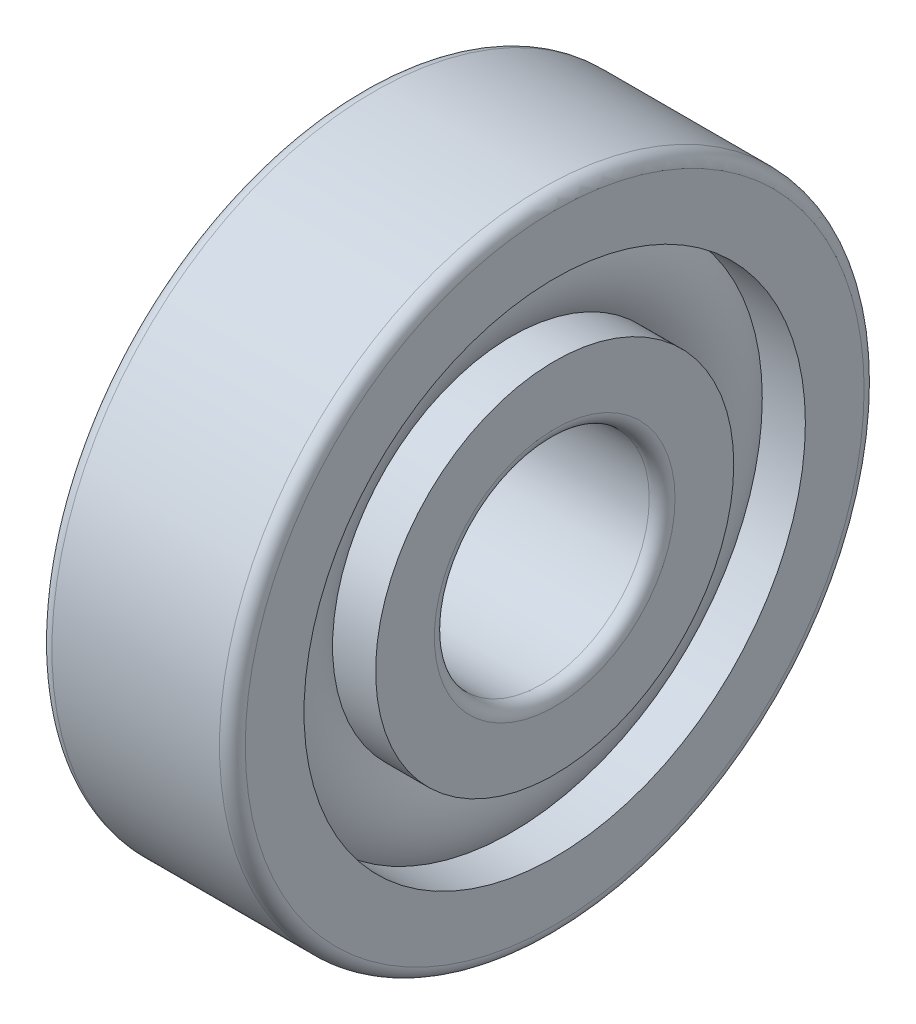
ISO-10303-21;
HEADER;
FILE_DESCRIPTION(('STEP AP214'),'2;1');
FILE_NAME('part.step','',(''),(''),'','','');
FILE_SCHEMA(('AUTOMOTIVE_DESIGN { 1 0 10303 214 1 1 1 1 }'));
ENDSEC;
DATA;
#1=APPLICATION_CONTEXT('core data for automotive mechanical design processes');
#2=APPLICATION_PROTOCOL_DEFINITION('international standard','automotive_design',2000,#1);
#3=PRODUCT_CONTEXT('',#1,'mechanical');
#4=PRODUCT('Part','Part','',(#3));
#5=PRODUCT_RELATED_PRODUCT_CATEGORY('part','',(#4));
#6=PRODUCT_DEFINITION_FORMATION('','',#4);
#7=PRODUCT_DEFINITION_CONTEXT('part definition',#1,'design');
#8=PRODUCT_DEFINITION('design','',#6,#7);
#9=PRODUCT_DEFINITION_SHAPE('','',#8);
#10=(LENGTH_UNIT() NAMED_UNIT(*) SI_UNIT(.MILLI.,.METRE.));
#11=(NAMED_UNIT(*) PLANE_ANGLE_UNIT() SI_UNIT($,.RADIAN.));
#12=(NAMED_UNIT(*) SI_UNIT($,.STERADIAN.) SOLID_ANGLE_UNIT());
#13=UNCERTAINTY_MEASURE_WITH_UNIT(LENGTH_MEASURE(1.E-05),#10,'distance_accuracy_value','');
#14=(GEOMETRIC_REPRESENTATION_CONTEXT(3) GLOBAL_UNCERTAINTY_ASSIGNED_CONTEXT((#13)) GLOBAL_UNIT_ASSIGNED_CONTEXT((#10,
#11,#12)) REPRESENTATION_CONTEXT('',''));
#15=CARTESIAN_POINT('',(0.,0.,0.));
#16=DIRECTION('',(0.,0.,1.));
#17=DIRECTION('',(1.,0.,0.));
#18=AXIS2_PLACEMENT_3D('',#15,#16,#17);
#19=CARTESIAN_POINT('',(0.599999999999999,0.,0.));
#20=DIRECTION('',(1.,0.,0.));
#21=DIRECTION('',(0.,0.,-1.));
#22=AXIS2_PLACEMENT_3D('',#19,#20,#21);
#23=TOROIDAL_SURFACE('',#22,14.4,0.599999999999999);
#24=CARTESIAN_POINT('',(0.,0.,0.));
#25=DIRECTION('',(1.,0.,0.));
#26=DIRECTION('',(0.,0.,-1.));
#27=AXIS2_PLACEMENT_3D('',#24,#25,#26);
#28=CIRCLE('',#27,14.4);
#29=CARTESIAN_POINT('',(0.,0.,-14.4));
#30=VERTEX_POINT('',#29);
#31=EDGE_CURVE('E10',#30,#30,#28,.T.);
#32=ORIENTED_EDGE('',*,*,#31,.T.);
#33=EDGE_LOOP('',(#32));
#34=FACE_BOUND('',#33,.T.);
#35=CARTESIAN_POINT('',(0.6,0.,0.));
#36=DIRECTION('',(1.,0.,0.));
#37=DIRECTION('',(0.,0.,-1.));
#38=AXIS2_PLACEMENT_3D('',#35,#36,#37);
#39=CIRCLE('',#38,15.);
#40=CARTESIAN_POINT('',(0.6,0.,-15.));
#41=VERTEX_POINT('',#40);
#42=EDGE_CURVE('E81',#41,#41,#39,.T.);
#43=ORIENTED_EDGE('',*,*,#42,.F.);
#44=EDGE_LOOP('',(#43));
#45=FACE_BOUND('',#44,.T.);
#46=ADVANCED_FACE('F29',(#34,#45),#23,.T.);
#47=CARTESIAN_POINT('',(0.,14.4,0.));
#48=DIRECTION('',(-1.,0.,0.));
#49=DIRECTION('',(0.,0.,1.));
#50=AXIS2_PLACEMENT_3D('',#47,#48,#49);
#51=PLANE('',#50);
#52=CARTESIAN_POINT('',(0.,0.,0.));
#53=DIRECTION('',(1.,0.,0.));
#54=DIRECTION('',(0.,0.,-1.));
#55=AXIS2_PLACEMENT_3D('',#52,#53,#54);
#56=CIRCLE('',#55,11.6666666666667);
#57=CARTESIAN_POINT('',(0.,0.,-11.6666666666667));
#58=VERTEX_POINT('',#57);
#59=EDGE_CURVE('E35',#58,#58,#56,.T.);
#60=ORIENTED_EDGE('',*,*,#59,.T.);
#61=EDGE_LOOP('',(#60));
#62=FACE_BOUND('',#61,.T.);
#63=ORIENTED_EDGE('',*,*,#31,.F.);
#64=EDGE_LOOP('',(#63));
#65=FACE_BOUND('',#64,.T.);
#66=ADVANCED_FACE('F89',(#62,#65),#51,.T.);
#67=CARTESIAN_POINT('',(9.,0.,0.));
#68=DIRECTION('',(1.,0.,0.));
#69=DIRECTION('',(0.,0.,-1.));
#70=AXIS2_PLACEMENT_3D('',#67,#68,#69);
#71=CYLINDRICAL_SURFACE('',#70,11.6666666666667);
#72=CARTESIAN_POINT('',(2.00556174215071,0.,0.));
#73=DIRECTION('',(1.,0.,0.));
#74=DIRECTION('',(0.,0.,-1.));
#75=AXIS2_PLACEMENT_3D('',#72,#73,#74);
#76=CIRCLE('',#75,11.6666666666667);
#77=CARTESIAN_POINT('',(2.00556174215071,0.,-11.6666666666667));
#78=VERTEX_POINT('',#77);
#79=EDGE_CURVE('E39',#78,#78,#76,.T.);
#80=ORIENTED_EDGE('',*,*,#79,.T.);
#81=EDGE_LOOP('',(#80));
#82=FACE_BOUND('',#81,.T.);
#83=ORIENTED_EDGE('',*,*,#59,.F.);
#84=EDGE_LOOP('',(#83));
#85=FACE_BOUND('',#84,.T.);
#86=ADVANCED_FACE('F93',(#82,#85),#71,.F.);
#87=CARTESIAN_POINT('',(4.5,0.,0.));
#88=DIRECTION('',(1.,0.,0.));
#89=DIRECTION('',(0.,0.,-1.));
#90=AXIS2_PLACEMENT_3D('',#87,#88,#89);
#91=TOROIDAL_SURFACE('',#90,10.,3.);
#92=CARTESIAN_POINT('',(2.00556174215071,0.,0.));
#93=DIRECTION('',(1.,0.,0.));
#94=DIRECTION('',(0.,0.,-1.));
#95=AXIS2_PLACEMENT_3D('',#92,#93,#94);
#96=CIRCLE('',#95,8.33333333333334);
#97=CARTESIAN_POINT('',(2.00556174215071,0.,-8.33333333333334));
#98=VERTEX_POINT('',#97);
#99=EDGE_CURVE('E43',#98,#98,#96,.T.);
#100=ORIENTED_EDGE('',*,*,#99,.T.);
#101=EDGE_LOOP('',(#100));
#102=FACE_BOUND('',#101,.T.);
#103=ORIENTED_EDGE('',*,*,#79,.F.);
#104=EDGE_LOOP('',(#103));
#105=FACE_BOUND('',#104,.T.);
#106=ADVANCED_FACE('F97',(#102,#105),#91,.T.);
#107=CARTESIAN_POINT('',(9.,0.,0.));
#108=DIRECTION('',(1.,0.,0.));
#109=DIRECTION('',(0.,0.,-1.));
#110=AXIS2_PLACEMENT_3D('',#107,#108,#109);
#111=CYLINDRICAL_SURFACE('',#110,8.33333333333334);
#112=CARTESIAN_POINT('',(0.,0.,0.));
#113=DIRECTION('',(1.,0.,0.));
#114=DIRECTION('',(0.,0.,-1.));
#115=AXIS2_PLACEMENT_3D('',#112,#113,#114);
#116=CIRCLE('',#115,8.33333333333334);
#117=CARTESIAN_POINT('',(0.,0.,-8.33333333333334));
#118=VERTEX_POINT('',#117);
#119=EDGE_CURVE('E48',#118,#118,#116,.T.);
#120=ORIENTED_EDGE('',*,*,#119,.T.);
#121=EDGE_LOOP('',(#120));
#122=FACE_BOUND('',#121,.T.);
#123=ORIENTED_EDGE('',*,*,#99,.F.);
#124=EDGE_LOOP('',(#123));
#125=FACE_BOUND('',#124,.T.);
#126=ADVANCED_FACE('F104',(#122,#125),#111,.T.);
#127=CARTESIAN_POINT('',(0.,8.33333333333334,0.));
#128=DIRECTION('',(-1.,0.,0.));
#129=DIRECTION('',(0.,0.,1.));
#130=AXIS2_PLACEMENT_3D('',#127,#128,#129);
#131=PLANE('',#130);
#132=CARTESIAN_POINT('',(0.,0.,0.));
#133=DIRECTION('',(1.,0.,0.));
#134=DIRECTION('',(0.,0.,-1.));
#135=AXIS2_PLACEMENT_3D('',#132,#133,#134);
#136=CIRCLE('',#135,5.6);
#137=CARTESIAN_POINT('',(0.,0.,-5.6));
#138=VERTEX_POINT('',#137);
#139=EDGE_CURVE('E51',#138,#138,#136,.T.);
#140=ORIENTED_EDGE('',*,*,#139,.T.);
#141=EDGE_LOOP('',(#140));
#142=FACE_BOUND('',#141,.T.);
#143=ORIENTED_EDGE('',*,*,#119,.F.);
#144=EDGE_LOOP('',(#143));
#145=FACE_BOUND('',#144,.T.);
#146=ADVANCED_FACE('F108',(#142,#145),#131,.T.);
#147=CARTESIAN_POINT('',(0.6,0.,0.));
#148=DIRECTION('',(1.,0.,0.));
#149=DIRECTION('',(0.,0.,-1.));
#150=AXIS2_PLACEMENT_3D('',#147,#148,#149);
#151=TOROIDAL_SURFACE('',#150,5.6,0.6);
#152=CARTESIAN_POINT('',(0.6,0.,0.));
#153=DIRECTION('',(1.,0.,0.));
#154=DIRECTION('',(0.,0.,-1.));
#155=AXIS2_PLACEMENT_3D('',#152,#153,#154);
#156=CIRCLE('',#155,5.);
#157=CARTESIAN_POINT('',(0.6,0.,-5.));
#158=VERTEX_POINT('',#157);
#159=EDGE_CURVE('E54',#158,#158,#156,.T.);
#160=ORIENTED_EDGE('',*,*,#159,.T.);
#161=EDGE_LOOP('',(#160));
#162=FACE_BOUND('',#161,.T.);
#163=ORIENTED_EDGE('',*,*,#139,.F.);
#164=EDGE_LOOP('',(#163));
#165=FACE_BOUND('',#164,.T.);
#166=ADVANCED_FACE('F112',(#162,#165),#151,.T.);
#167=CARTESIAN_POINT('',(9.,0.,0.));
#168=DIRECTION('',(1.,0.,0.));
#169=DIRECTION('',(0.,0.,-1.));
#170=AXIS2_PLACEMENT_3D('',#167,#168,#169);
#171=CYLINDRICAL_SURFACE('',#170,5.);
#172=CARTESIAN_POINT('',(8.4,0.,0.));
#173=DIRECTION('',(1.,0.,0.));
#174=DIRECTION('',(0.,0.,-1.));
#175=AXIS2_PLACEMENT_3D('',#172,#173,#174);
#176=CIRCLE('',#175,5.);
#177=CARTESIAN_POINT('',(8.4,0.,-5.));
#178=VERTEX_POINT('',#177);
#179=EDGE_CURVE('E57',#178,#178,#176,.T.);
#180=ORIENTED_EDGE('',*,*,#179,.T.);
#181=EDGE_LOOP('',(#180));
#182=FACE_BOUND('',#181,.T.);
#183=ORIENTED_EDGE('',*,*,#159,.F.);
#184=EDGE_LOOP('',(#183));
#185=FACE_BOUND('',#184,.T.);
#186=ADVANCED_FACE('F116',(#182,#185),#171,.F.);
#187=CARTESIAN_POINT('',(8.4,0.,0.));
#188=DIRECTION('',(1.,0.,0.));
#189=DIRECTION('',(0.,0.,-1.));
#190=AXIS2_PLACEMENT_3D('',#187,#188,#189);
#191=TOROIDAL_SURFACE('',#190,5.6,0.6);
#192=CARTESIAN_POINT('',(9.,0.,0.));
#193=DIRECTION('',(1.,0.,0.));
#194=DIRECTION('',(0.,0.,-1.));
#195=AXIS2_PLACEMENT_3D('',#192,#193,#194);
#196=CIRCLE('',#195,5.6);
#197=CARTESIAN_POINT('',(9.,0.,-5.6));
#198=VERTEX_POINT('',#197);
#199=EDGE_CURVE('E60',#198,#198,#196,.T.);
#200=ORIENTED_EDGE('',*,*,#199,.T.);
#201=EDGE_LOOP('',(#200));
#202=FACE_BOUND('',#201,.T.);
#203=ORIENTED_EDGE('',*,*,#179,.F.);
#204=EDGE_LOOP('',(#203));
#205=FACE_BOUND('',#204,.T.);
#206=ADVANCED_FACE('F120',(#202,#205),#191,.T.);
#207=CARTESIAN_POINT('',(9.,5.6,0.));
#208=DIRECTION('',(1.,0.,0.));
#209=DIRECTION('',(0.,0.,-1.));
#210=AXIS2_PLACEMENT_3D('',#207,#208,#209);
#211=PLANE('',#210);
#212=CARTESIAN_POINT('',(9.,0.,0.));
#213=DIRECTION('',(1.,0.,0.));
#214=DIRECTION('',(0.,0.,-1.));
#215=AXIS2_PLACEMENT_3D('',#212,#213,#214);
#216=CIRCLE('',#215,8.33333333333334);
#217=CARTESIAN_POINT('',(9.,0.,-8.33333333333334));
#218=VERTEX_POINT('',#217);
#219=EDGE_CURVE('E63',#218,#218,#216,.T.);
#220=ORIENTED_EDGE('',*,*,#219,.T.);
#221=EDGE_LOOP('',(#220));
#222=FACE_BOUND('',#221,.T.);
#223=ORIENTED_EDGE('',*,*,#199,.F.);
#224=EDGE_LOOP('',(#223));
#225=FACE_BOUND('',#224,.T.);
#226=ADVANCED_FACE('F124',(#222,#225),#211,.T.);
#227=CARTESIAN_POINT('',(9.,0.,0.));
#228=DIRECTION('',(1.,0.,0.));
#229=DIRECTION('',(0.,0.,-1.));
#230=AXIS2_PLACEMENT_3D('',#227,#228,#229);
#231=CYLINDRICAL_SURFACE('',#230,8.33333333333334);
#232=CARTESIAN_POINT('',(6.99443825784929,0.,0.));
#233=DIRECTION('',(1.,0.,0.));
#234=DIRECTION('',(0.,0.,-1.));
#235=AXIS2_PLACEMENT_3D('',#232,#233,#234);
#236=CIRCLE('',#235,8.33333333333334);
#237=CARTESIAN_POINT('',(6.99443825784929,0.,-8.33333333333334));
#238=VERTEX_POINT('',#237);
#239=EDGE_CURVE('E66',#238,#238,#236,.T.);
#240=ORIENTED_EDGE('',*,*,#239,.T.);
#241=EDGE_LOOP('',(#240));
#242=FACE_BOUND('',#241,.T.);
#243=ORIENTED_EDGE('',*,*,#219,.F.);
#244=EDGE_LOOP('',(#243));
#245=FACE_BOUND('',#244,.T.);
#246=ADVANCED_FACE('F128',(#242,#245),#231,.T.);
#247=CARTESIAN_POINT('',(4.5,0.,0.));
#248=DIRECTION('',(1.,0.,0.));
#249=DIRECTION('',(0.,0.,-1.));
#250=AXIS2_PLACEMENT_3D('',#247,#248,#249);
#251=TOROIDAL_SURFACE('',#250,10.,3.);
#252=CARTESIAN_POINT('',(6.99443825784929,0.,0.));
#253=DIRECTION('',(1.,0.,0.));
#254=DIRECTION('',(0.,0.,-1.));
#255=AXIS2_PLACEMENT_3D('',#252,#253,#254);
#256=CIRCLE('',#255,11.6666666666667);
#257=CARTESIAN_POINT('',(6.99443825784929,0.,-11.6666666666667));
#258=VERTEX_POINT('',#257);
#259=EDGE_CURVE('E69',#258,#258,#256,.T.);
#260=ORIENTED_EDGE('',*,*,#259,.T.);
#261=EDGE_LOOP('',(#260));
#262=FACE_BOUND('',#261,.T.);
#263=ORIENTED_EDGE('',*,*,#239,.F.);
#264=EDGE_LOOP('',(#263));
#265=FACE_BOUND('',#264,.T.);
#266=ADVANCED_FACE('F132',(#262,#265),#251,.T.);
#267=CARTESIAN_POINT('',(9.,0.,0.));
#268=DIRECTION('',(1.,0.,0.));
#269=DIRECTION('',(0.,0.,-1.));
#270=AXIS2_PLACEMENT_3D('',#267,#268,#269);
#271=CYLINDRICAL_SURFACE('',#270,11.6666666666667);
#272=CARTESIAN_POINT('',(9.,0.,0.));
#273=DIRECTION('',(1.,0.,0.));
#274=DIRECTION('',(0.,0.,-1.));
#275=AXIS2_PLACEMENT_3D('',#272,#273,#274);
#276=CIRCLE('',#275,11.6666666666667);
#277=CARTESIAN_POINT('',(9.,0.,-11.6666666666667));
#278=VERTEX_POINT('',#277);
#279=EDGE_CURVE('E72',#278,#278,#276,.T.);
#280=ORIENTED_EDGE('',*,*,#279,.T.);
#281=EDGE_LOOP('',(#280));
#282=FACE_BOUND('',#281,.T.);
#283=ORIENTED_EDGE('',*,*,#259,.F.);
#284=EDGE_LOOP('',(#283));
#285=FACE_BOUND('',#284,.T.);
#286=ADVANCED_FACE('F136',(#282,#285),#271,.F.);
#287=CARTESIAN_POINT('',(9.,11.6666666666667,0.));
#288=DIRECTION('',(1.,0.,0.));
#289=DIRECTION('',(0.,0.,-1.));
#290=AXIS2_PLACEMENT_3D('',#287,#288,#289);
#291=PLANE('',#290);
#292=CARTESIAN_POINT('',(9.,0.,0.));
#293=DIRECTION('',(1.,0.,0.));
#294=DIRECTION('',(0.,0.,-1.));
#295=AXIS2_PLACEMENT_3D('',#292,#293,#294);
#296=CIRCLE('',#295,14.4);
#297=CARTESIAN_POINT('',(9.,0.,-14.4));
#298=VERTEX_POINT('',#297);
#299=EDGE_CURVE('E75',#298,#298,#296,.T.);
#300=ORIENTED_EDGE('',*,*,#299,.T.);
#301=EDGE_LOOP('',(#300));
#302=FACE_BOUND('',#301,.T.);
#303=ORIENTED_EDGE('',*,*,#279,.F.);
#304=EDGE_LOOP('',(#303));
#305=FACE_BOUND('',#304,.T.);
#306=ADVANCED_FACE('F140',(#302,#305),#291,.T.);
#307=CARTESIAN_POINT('',(8.4,0.,0.));
#308=DIRECTION('',(1.,0.,0.));
#309=DIRECTION('',(0.,0.,-1.));
#310=AXIS2_PLACEMENT_3D('',#307,#308,#309);
#311=TOROIDAL_SURFACE('',#310,14.4,0.599999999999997);
#312=CARTESIAN_POINT('',(8.4,0.,0.));
#313=DIRECTION('',(1.,0.,0.));
#314=DIRECTION('',(0.,0.,-1.));
#315=AXIS2_PLACEMENT_3D('',#312,#313,#314);
#316=CIRCLE('',#315,15.);
#317=CARTESIAN_POINT('',(8.4,0.,-15.));
#318=VERTEX_POINT('',#317);
#319=EDGE_CURVE('E78',#318,#318,#316,.T.);
#320=ORIENTED_EDGE('',*,*,#319,.T.);
#321=EDGE_LOOP('',(#320));
#322=FACE_BOUND('',#321,.T.);
#323=ORIENTED_EDGE('',*,*,#299,.F.);
#324=EDGE_LOOP('',(#323));
#325=FACE_BOUND('',#324,.T.);
#326=ADVANCED_FACE('F144',(#322,#325),#311,.T.);
#327=CARTESIAN_POINT('',(9.,0.,0.));
#328=DIRECTION('',(1.,0.,0.));
#329=DIRECTION('',(0.,0.,-1.));
#330=AXIS2_PLACEMENT_3D('',#327,#328,#329);
#331=CYLINDRICAL_SURFACE('',#330,15.);
#332=ORIENTED_EDGE('',*,*,#42,.T.);
#333=EDGE_LOOP('',(#332));
#334=FACE_BOUND('',#333,.T.);
#335=ORIENTED_EDGE('',*,*,#319,.F.);
#336=EDGE_LOOP('',(#335));
#337=FACE_BOUND('',#336,.T.);
#338=ADVANCED_FACE('F85',(#334,#337),#331,.T.);
#339=CLOSED_SHELL('',(#46,#66,#86,#106,#126,#146,#166,#186,#206,#226,#246,#266,#286,#306,#326,#338));
#340=CARTESIAN_POINT('',(4.5,0.,0.));
#341=DIRECTION('',(1.,0.,0.));
#342=DIRECTION('',(0.,0.,-1.));
#343=AXIS2_PLACEMENT_3D('',#340,#341,#342);
#344=TOROIDAL_SURFACE('',#343,10.,2.85);
#345=CARTESIAN_POINT('',(4.5,0.,-12.85));
#346=VERTEX_POINT('',#345);
#347=VERTEX_LOOP('',#346);
#348=FACE_BOUND('',#347,.T.);
#349=ADVANCED_FACE('F151',(#348),#344,.F.);
#350=CLOSED_SHELL('',(#349));
#351=ORIENTED_CLOSED_SHELL('',*,#350,.T.);
#352=BREP_WITH_VOIDS('B2',#339,(#351));
#353=ADVANCED_BREP_SHAPE_REPRESENTATION('',(#18,#352),#14);
#354=SHAPE_DEFINITION_REPRESENTATION(#9,#353);
ENDSEC;
END-ISO-10303-21;
